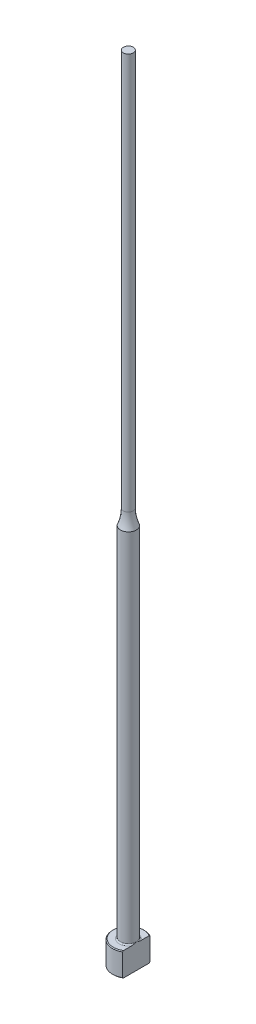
from build123d import *
from build123d.topology import SkipClean

# Parameters (mm, degrees)
CHAMFER1_SIZE    = 0.2
FILLET1_R        = 0.3
KEYED_HEAD_DEPTH = 201.079984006


with BuildPart() as part:
    # Sketch1 → Revolve1 (revolve)
    with BuildSketch(Plane.XY, mode=Mode.PRIVATE) as revolve1_sk:
        with BuildLine():
            Line((0, 0), (-4, 0))
            Line((-4, 0), (-4, 6))
            Line((-4, 6), (-2, 6))
            Line((-2, 6), (-2, 96.200328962))
            ThreePointArc((-2, 96.200328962), (-1.439291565, 98.063508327), (-1.25, 100))
            Line((-1.25, 100), (-1.25, 200))
            Line((-1.25, 200), (0, 200))
            Line((0, 200), (0, 0))
        make_face()
    revolve(revolve1_sk.sketch.rotate(Axis((0, 259.958771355, 0), (0, -1, 0)), 270), axis=Axis((0, 259.958771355, 0), (0, -1, 0)))

    # Chamfer1
    chamfer1_edges = [part.edges().sort_by_distance(p)[0] for p in [
        (0, 0, -4),
        (0, 6, -4),
    ]]
    chamfer(chamfer1_edges, length=CHAMFER1_SIZE)

    # Fillet1
    fillet1_edges = [part.edges().sort_by_distance(p)[0] for p in [
        (0, 6, -2),
    ]]
    fillet(fillet1_edges, radius=FILLET1_R)

    # Sketch2 → Keyed Head (cut, through all)
    with SkipClean():  # the faces are left unmerged after this step: merging them gives an invalid solid
        with BuildSketch(Plane(origin=(0, 0, 0), x_dir=(1, 0, 0), z_dir=(0, 1, 0))):
            with BuildLine():
                Line((2, -3.464101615), (2, 3.464101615))
                ThreePointArc((2, 3.464101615), (4, 0), (2, -3.464101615))
            make_face()
        extrude(amount=KEYED_HEAD_DEPTH, mode=Mode.SUBTRACT)


solid = part.part
